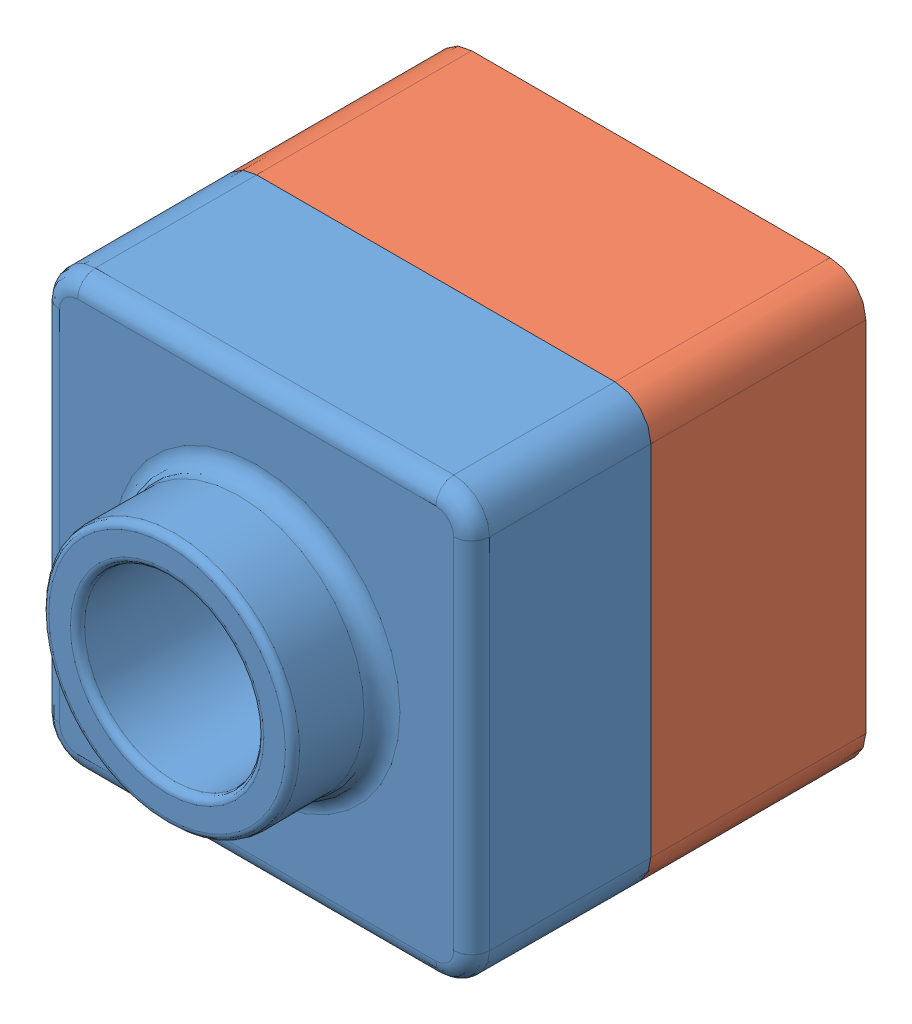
SolidWorks assembly Tutor.SLDASM, configuration Default (file format 8000). Lengths in mm.
Overall size (120 120 135).
2 component instances, 2 part files, 6 mates.
Components (placement in the parent):
- Tutor1-1: Tutor1.SLDPRT [Default] at origin size (120 120 75)
- Tutor2-1: Tutor2.SLDPRT [Default] at (0 0 -60) size (120 120 90)
Mates (geometry in assembly coordinates):
- Coincident1: coincident aligned: line of Tutor1-1 through (110 120 0) axis (-1 0 0); line of Tutor2-1 through (110 120 0) axis (-1 0 0)
- Coincident2: coincident aligned: plane of Tutor1-1 through (120 0 50) normal (1 0 0); plane of Tutor2-1 through (120 0 30) normal (1 0 0)
- Coincident3: coincident aligned: plane of Tutor1-1 through (0 120 50) normal (0 1 0); plane of Tutor2-1 through (0 120 30) normal (0 1 0)
- Coincident4: coincident aligned: plane of Tutor1-1 through (0 0 0) normal (0 0 1); plane of assembly through (0 0 0) normal (0 0 1)
- Coincident5: coincident aligned: plane of Tutor1-1 through (0 0 0) normal (0 1 0); plane of assembly through (0 0 0) normal (0 1 0)
- Coincident6: coincident aligned: plane of Tutor1-1 through (0 0 0) normal (1 0 0); plane of assembly through (0 0 0) normal (1 0 0)
